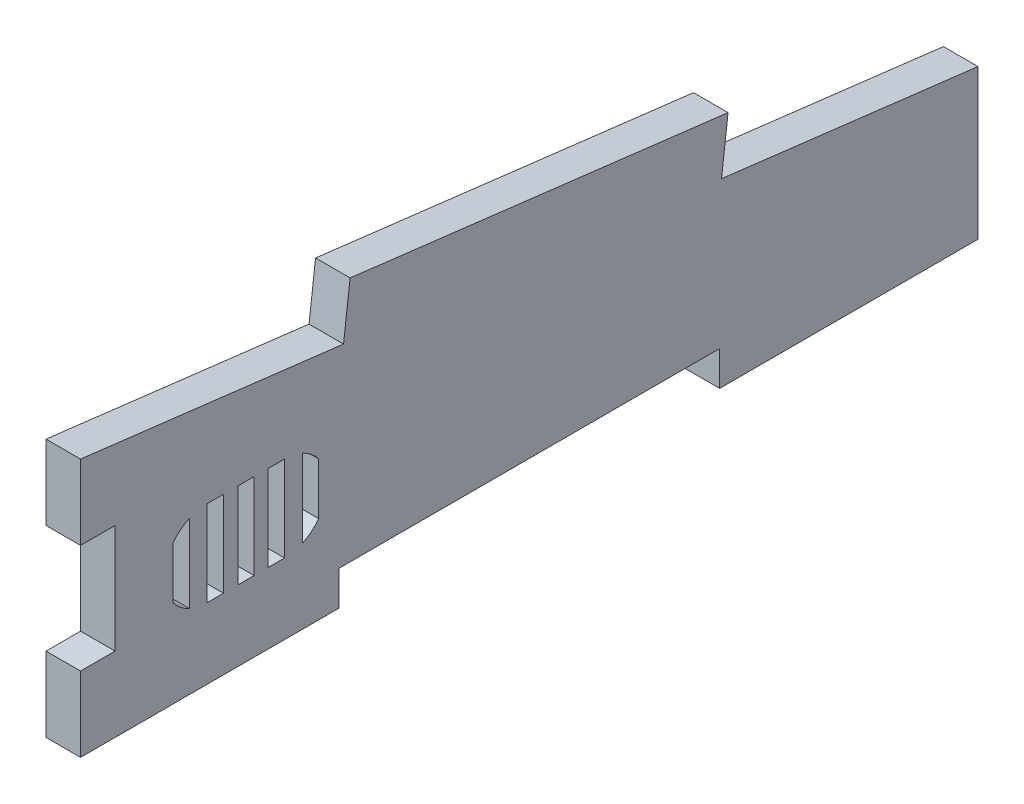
ISO-10303-21;
HEADER;
FILE_DESCRIPTION(('STEP AP214'),'2;1');
FILE_NAME('part.step','',(''),(''),'','','');
FILE_SCHEMA(('AUTOMOTIVE_DESIGN { 1 0 10303 214 1 1 1 1 }'));
ENDSEC;
DATA;
#1=APPLICATION_CONTEXT('core data for automotive mechanical design processes');
#2=APPLICATION_PROTOCOL_DEFINITION('international standard','automotive_design',2000,#1);
#3=PRODUCT_CONTEXT('',#1,'mechanical');
#4=PRODUCT('Part','Part','',(#3));
#5=PRODUCT_RELATED_PRODUCT_CATEGORY('part','',(#4));
#6=PRODUCT_DEFINITION_FORMATION('','',#4);
#7=PRODUCT_DEFINITION_CONTEXT('part definition',#1,'design');
#8=PRODUCT_DEFINITION('design','',#6,#7);
#9=PRODUCT_DEFINITION_SHAPE('','',#8);
#10=(LENGTH_UNIT() NAMED_UNIT(*) SI_UNIT(.MILLI.,.METRE.));
#11=(NAMED_UNIT(*) PLANE_ANGLE_UNIT() SI_UNIT($,.RADIAN.));
#12=(NAMED_UNIT(*) SI_UNIT($,.STERADIAN.) SOLID_ANGLE_UNIT());
#13=UNCERTAINTY_MEASURE_WITH_UNIT(LENGTH_MEASURE(1.E-05),#10,'distance_accuracy_value','');
#14=(GEOMETRIC_REPRESENTATION_CONTEXT(3) GLOBAL_UNCERTAINTY_ASSIGNED_CONTEXT((#13)) GLOBAL_UNIT_ASSIGNED_CONTEXT((#10,
#11,#12)) REPRESENTATION_CONTEXT('',''));
#15=CARTESIAN_POINT('',(0.,0.,0.));
#16=DIRECTION('',(0.,0.,1.));
#17=DIRECTION('',(1.,0.,0.));
#18=AXIS2_PLACEMENT_3D('',#15,#16,#17);
#19=CARTESIAN_POINT('',(6.35,0.,0.));
#20=DIRECTION('',(-1.,0.,0.));
#21=DIRECTION('',(0.,0.,1.));
#22=AXIS2_PLACEMENT_3D('',#19,#20,#21);
#23=PLANE('',#22);
#24=DIRECTION('',(0.,0.,1.));
#25=VECTOR('',#24,1.);
#26=CARTESIAN_POINT('',(6.35,-41.073724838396,96.0034406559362));
#27=LINE('',#26,#25);
#28=CARTESIAN_POINT('',(6.35,-41.073724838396,96.0034406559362));
#29=VERTEX_POINT('',#28);
#30=CARTESIAN_POINT('',(6.35,-41.073724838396,99.0034406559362));
#31=VERTEX_POINT('',#30);
#32=EDGE_CURVE('E306',#29,#31,#27,.T.);
#33=ORIENTED_EDGE('',*,*,#32,.F.);
#34=DIRECTION('',(0.,1.,0.));
#35=VECTOR('',#34,1.);
#36=CARTESIAN_POINT('',(6.35,-41.073724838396,96.0034406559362));
#37=LINE('',#36,#35);
#38=CARTESIAN_POINT('',(6.35,-56.8333333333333,96.0034406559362));
#39=VERTEX_POINT('',#38);
#40=EDGE_CURVE('E314',#39,#29,#37,.T.);
#41=ORIENTED_EDGE('',*,*,#40,.F.);
#42=DIRECTION('',(0.,0.,-1.));
#43=VECTOR('',#42,1.);
#44=CARTESIAN_POINT('',(6.35,-56.8333333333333,96.0034406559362));
#45=LINE('',#44,#43);
#46=CARTESIAN_POINT('',(6.35,-56.8333333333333,99.0034406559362));
#47=VERTEX_POINT('',#46);
#48=EDGE_CURVE('E311',#47,#39,#45,.T.);
#49=ORIENTED_EDGE('',*,*,#48,.F.);
#50=DIRECTION('',(0.,-1.,0.));
#51=VECTOR('',#50,1.);
#52=CARTESIAN_POINT('',(6.35,-41.073724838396,99.0034406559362));
#53=LINE('',#52,#51);
#54=EDGE_CURVE('E308',#31,#47,#53,.T.);
#55=ORIENTED_EDGE('',*,*,#54,.F.);
#56=EDGE_LOOP('',(#33,#41,#49,#55));
#57=FACE_BOUND('',#56,.T.);
#58=DIRECTION('',(0.,0.,-1.));
#59=VECTOR('',#58,1.);
#60=CARTESIAN_POINT('',(6.35,-56.8333333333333,101.635580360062));
#61=LINE('',#60,#59);
#62=CARTESIAN_POINT('',(6.35,-56.8333333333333,104.635580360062));
#63=VERTEX_POINT('',#62);
#64=CARTESIAN_POINT('',(6.35,-56.8333333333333,101.635580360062));
#65=VERTEX_POINT('',#64);
#66=EDGE_CURVE('E368',#63,#65,#61,.T.);
#67=ORIENTED_EDGE('',*,*,#66,.F.);
#68=DIRECTION('',(0.,-1.,0.));
#69=VECTOR('',#68,1.);
#70=CARTESIAN_POINT('',(6.35,-41.073724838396,104.635580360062));
#71=LINE('',#70,#69);
#72=CARTESIAN_POINT('',(6.35,-41.073724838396,104.635580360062));
#73=VERTEX_POINT('',#72);
#74=EDGE_CURVE('E376',#73,#63,#71,.T.);
#75=ORIENTED_EDGE('',*,*,#74,.F.);
#76=DIRECTION('',(0.,0.,1.));
#77=VECTOR('',#76,1.);
#78=CARTESIAN_POINT('',(6.35,-41.073724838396,101.635580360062));
#79=LINE('',#78,#77);
#80=CARTESIAN_POINT('',(6.35,-41.073724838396,101.635580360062));
#81=VERTEX_POINT('',#80);
#82=EDGE_CURVE('E373',#81,#73,#79,.T.);
#83=ORIENTED_EDGE('',*,*,#82,.F.);
#84=DIRECTION('',(0.,1.,0.));
#85=VECTOR('',#84,1.);
#86=CARTESIAN_POINT('',(6.35,-56.8333333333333,101.635580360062));
#87=LINE('',#86,#85);
#88=EDGE_CURVE('E370',#65,#81,#87,.T.);
#89=ORIENTED_EDGE('',*,*,#88,.F.);
#90=EDGE_LOOP('',(#67,#75,#83,#89));
#91=FACE_BOUND('',#90,.T.);
#92=DIRECTION('',(0.,0.120331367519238,0.992733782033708));
#93=VECTOR('',#92,1.);
#94=CARTESIAN_POINT('',(6.35,-28.194397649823,79.5600376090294));
#95=LINE('',#94,#93);
#96=CARTESIAN_POINT('',(6.35,-28.194397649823,79.5600376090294));
#97=VERTEX_POINT('',#96);
#98=CARTESIAN_POINT('',(6.35,-22.3333333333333,127.913818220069));
#99=VERTEX_POINT('',#98);
#100=EDGE_CURVE('E430',#97,#99,#95,.T.);
#101=ORIENTED_EDGE('',*,*,#100,.T.);
#102=DIRECTION('',(0.,-1.,0.));
#103=VECTOR('',#102,1.);
#104=CARTESIAN_POINT('',(6.35,-22.3333333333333,127.913818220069));
#105=LINE('',#104,#103);
#106=CARTESIAN_POINT('',(6.35,-36.0833333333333,127.913818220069));
#107=VERTEX_POINT('',#106);
#108=EDGE_CURVE('E433',#99,#107,#105,.T.);
#109=ORIENTED_EDGE('',*,*,#108,.T.);
#110=DIRECTION('',(0.,0.,-1.));
#111=VECTOR('',#110,1.);
#112=CARTESIAN_POINT('',(6.35,-36.0833333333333,127.913818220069));
#113=LINE('',#112,#111);
#114=CARTESIAN_POINT('',(6.35,-36.0833333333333,121.563818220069));
#115=VERTEX_POINT('',#114);
#116=EDGE_CURVE('E436',#107,#115,#113,.T.);
#117=ORIENTED_EDGE('',*,*,#116,.T.);
#118=DIRECTION('',(0.,-1.,0.));
#119=VECTOR('',#118,1.);
#120=CARTESIAN_POINT('',(6.35,-36.0833333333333,121.563818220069));
#121=LINE('',#120,#119);
#122=CARTESIAN_POINT('',(6.35,-56.0833333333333,121.563818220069));
#123=VERTEX_POINT('',#122);
#124=EDGE_CURVE('E438',#115,#123,#121,.T.);
#125=ORIENTED_EDGE('',*,*,#124,.T.);
#126=DIRECTION('',(0.,0.,1.));
#127=VECTOR('',#126,1.);
#128=CARTESIAN_POINT('',(6.35,-56.0833333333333,127.913818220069));
#129=LINE('',#128,#127);
#130=CARTESIAN_POINT('',(6.35,-56.0833333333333,127.913818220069));
#131=VERTEX_POINT('',#130);
#132=EDGE_CURVE('E440',#123,#131,#129,.T.);
#133=ORIENTED_EDGE('',*,*,#132,.T.);
#134=DIRECTION('',(0.,-1.,0.));
#135=VECTOR('',#134,1.);
#136=CARTESIAN_POINT('',(6.35,-56.0833333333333,127.913818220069));
#137=LINE('',#136,#135);
#138=CARTESIAN_POINT('',(6.35,-69.8333333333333,127.913818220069));
#139=VERTEX_POINT('',#138);
#140=EDGE_CURVE('E442',#131,#139,#137,.T.);
#141=ORIENTED_EDGE('',*,*,#140,.T.);
#142=DIRECTION('',(0.,0.,-1.));
#143=VECTOR('',#142,1.);
#144=CARTESIAN_POINT('',(6.35,-69.8333333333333,127.913818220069));
#145=LINE('',#144,#143);
#146=CARTESIAN_POINT('',(6.35,-69.8333333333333,80.4138182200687));
#147=VERTEX_POINT('',#146);
#148=EDGE_CURVE('E444',#139,#147,#145,.T.);
#149=ORIENTED_EDGE('',*,*,#148,.T.);
#150=DIRECTION('',(0.,1.,0.));
#151=VECTOR('',#150,1.);
#152=CARTESIAN_POINT('',(6.35,-69.8333333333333,80.4138182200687));
#153=LINE('',#152,#151);
#154=CARTESIAN_POINT('',(6.35,-63.4833333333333,80.4138182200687));
#155=VERTEX_POINT('',#154);
#156=EDGE_CURVE('E446',#147,#155,#153,.T.);
#157=ORIENTED_EDGE('',*,*,#156,.T.);
#158=DIRECTION('',(0.,0.,-1.));
#159=VECTOR('',#158,1.);
#160=CARTESIAN_POINT('',(6.35,-63.4833333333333,80.4138182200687));
#161=LINE('',#160,#159);
#162=CARTESIAN_POINT('',(6.35,-63.4833333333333,10.4138182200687));
#163=VERTEX_POINT('',#162);
#164=EDGE_CURVE('E448',#155,#163,#161,.T.);
#165=ORIENTED_EDGE('',*,*,#164,.T.);
#166=DIRECTION('',(0.,-1.,0.));
#167=VECTOR('',#166,1.);
#168=CARTESIAN_POINT('',(6.35,-69.8333333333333,10.4138182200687));
#169=LINE('',#168,#167);
#170=CARTESIAN_POINT('',(6.35,-69.8333333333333,10.4138182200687));
#171=VERTEX_POINT('',#170);
#172=EDGE_CURVE('E450',#163,#171,#169,.T.);
#173=ORIENTED_EDGE('',*,*,#172,.T.);
#174=DIRECTION('',(0.,0.,-1.));
#175=VECTOR('',#174,1.);
#176=CARTESIAN_POINT('',(6.35,-69.8333333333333,10.4138182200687));
#177=LINE('',#176,#175);
#178=CARTESIAN_POINT('',(6.35,-69.8333333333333,-37.0861817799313));
#179=VERTEX_POINT('',#178);
#180=EDGE_CURVE('E452',#171,#179,#177,.T.);
#181=ORIENTED_EDGE('',*,*,#180,.T.);
#182=DIRECTION('',(0.,1.,0.));
#183=VECTOR('',#182,1.);
#184=CARTESIAN_POINT('',(6.35,-69.8333333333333,-37.0861817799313));
#185=LINE('',#184,#183);
#186=CARTESIAN_POINT('',(6.35,-42.3333333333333,-37.0861817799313));
#187=VERTEX_POINT('',#186);
#188=EDGE_CURVE('E454',#179,#187,#185,.T.);
#189=ORIENTED_EDGE('',*,*,#188,.T.);
#190=DIRECTION('',(0.,0.120331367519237,0.992733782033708));
#191=VECTOR('',#190,1.);
#192=CARTESIAN_POINT('',(6.35,-42.3333333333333,-37.0861817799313));
#193=LINE('',#192,#191);
#194=CARTESIAN_POINT('',(6.35,-36.6175933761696,10.0686728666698));
#195=VERTEX_POINT('',#194);
#196=EDGE_CURVE('E456',#187,#195,#193,.T.);
#197=ORIENTED_EDGE('',*,*,#196,.T.);
#198=DIRECTION('',(0.,0.992733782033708,-0.120331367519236));
#199=VECTOR('',#198,1.);
#200=CARTESIAN_POINT('',(6.35,-36.6175933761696,10.0686728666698));
#201=LINE('',#200,#199);
#202=CARTESIAN_POINT('',(6.35,-26.6902555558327,8.86535919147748));
#203=VERTEX_POINT('',#202);
#204=EDGE_CURVE('E458',#195,#203,#201,.T.);
#205=ORIENTED_EDGE('',*,*,#204,.T.);
#206=DIRECTION('',(0.,0.12033136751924,0.992733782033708));
#207=VECTOR('',#206,1.);
#208=CARTESIAN_POINT('',(6.35,-18.2670598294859,78.356723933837));
#209=LINE('',#208,#207);
#210=CARTESIAN_POINT('',(6.35,-18.2670598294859,78.356723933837));
#211=VERTEX_POINT('',#210);
#212=EDGE_CURVE('E460',#203,#211,#209,.T.);
#213=ORIENTED_EDGE('',*,*,#212,.T.);
#214=DIRECTION('',(0.,-0.992733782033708,0.120331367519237));
#215=VECTOR('',#214,1.);
#216=CARTESIAN_POINT('',(6.35,-28.194397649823,79.5600376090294));
#217=LINE('',#216,#215);
#218=EDGE_CURVE('E462',#211,#97,#217,.T.);
#219=ORIENTED_EDGE('',*,*,#218,.T.);
#220=EDGE_LOOP('',(#101,#109,#117,#125,#133,#141,#149,#157,#165,#173,#181,#189,#197,#205,#213,#219));
#221=FACE_BOUND('',#220,.T.);
#222=DIRECTION('',(0.,1.,0.));
#223=VECTOR('',#222,1.);
#224=CARTESIAN_POINT('',(6.35,-41.073724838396,90.4034406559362));
#225=LINE('',#224,#223);
#226=CARTESIAN_POINT('',(6.35,-56.8333333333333,90.4034406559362));
#227=VERTEX_POINT('',#226);
#228=CARTESIAN_POINT('',(6.35,-41.073724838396,90.4034406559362));
#229=VERTEX_POINT('',#228);
#230=EDGE_CURVE('E399',#227,#229,#225,.T.);
#231=ORIENTED_EDGE('',*,*,#230,.F.);
#232=DIRECTION('',(0.,0.,-1.));
#233=VECTOR('',#232,1.);
#234=CARTESIAN_POINT('',(6.35,-56.8333333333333,90.4034406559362));
#235=LINE('',#234,#233);
#236=CARTESIAN_POINT('',(6.35,-56.8333333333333,93.4034406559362));
#237=VERTEX_POINT('',#236);
#238=EDGE_CURVE('E407',#237,#227,#235,.T.);
#239=ORIENTED_EDGE('',*,*,#238,.F.);
#240=DIRECTION('',(0.,-1.,0.));
#241=VECTOR('',#240,1.);
#242=CARTESIAN_POINT('',(6.35,-56.8333333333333,93.4034406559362));
#243=LINE('',#242,#241);
#244=CARTESIAN_POINT('',(6.35,-41.073724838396,93.4034406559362));
#245=VERTEX_POINT('',#244);
#246=EDGE_CURVE('E404',#245,#237,#243,.T.);
#247=ORIENTED_EDGE('',*,*,#246,.F.);
#248=DIRECTION('',(0.,0.,1.));
#249=VECTOR('',#248,1.);
#250=CARTESIAN_POINT('',(6.35,-41.073724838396,90.4034406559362));
#251=LINE('',#250,#249);
#252=EDGE_CURVE('E401',#229,#245,#251,.T.);
#253=ORIENTED_EDGE('',*,*,#252,.F.);
#254=EDGE_LOOP('',(#231,#239,#247,#253));
#255=FACE_BOUND('',#254,.T.);
#256=CARTESIAN_POINT('',(6.35,-48.9535290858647,104.635580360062));
#257=DIRECTION('',(1.,0.,0.));
#258=DIRECTION('',(0.,0.,-1.));
#259=AXIS2_PLACEMENT_3D('',#256,#257,#258);
#260=CIRCLE('',#259,7.87980424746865);
#261=CARTESIAN_POINT('',(6.35,-41.7880234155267,107.913818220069));
#262=VERTEX_POINT('',#261);
#263=CARTESIAN_POINT('',(6.35,-44.1916970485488,110.913818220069));
#264=VERTEX_POINT('',#263);
#265=EDGE_CURVE('E337',#262,#264,#260,.T.);
#266=ORIENTED_EDGE('',*,*,#265,.F.);
#267=DIRECTION('',(0.,1.,0.));
#268=VECTOR('',#267,1.);
#269=CARTESIAN_POINT('',(6.35,-41.7880234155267,107.913818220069));
#270=LINE('',#269,#268);
#271=CARTESIAN_POINT('',(6.35,-56.1190347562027,107.913818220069));
#272=VERTEX_POINT('',#271);
#273=EDGE_CURVE('E345',#272,#262,#270,.T.);
#274=ORIENTED_EDGE('',*,*,#273,.F.);
#275=CARTESIAN_POINT('',(6.35,-48.9535290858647,104.635580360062));
#276=DIRECTION('',(1.,0.,0.));
#277=DIRECTION('',(0.,0.,-1.));
#278=AXIS2_PLACEMENT_3D('',#275,#276,#277);
#279=CIRCLE('',#278,7.87980424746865);
#280=CARTESIAN_POINT('',(6.35,-53.7153611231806,110.913818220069));
#281=VERTEX_POINT('',#280);
#282=EDGE_CURVE('E342',#281,#272,#279,.T.);
#283=ORIENTED_EDGE('',*,*,#282,.F.);
#284=DIRECTION('',(0.,-1.,0.));
#285=VECTOR('',#284,1.);
#286=CARTESIAN_POINT('',(6.35,-44.1916970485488,110.913818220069));
#287=LINE('',#286,#285);
#288=EDGE_CURVE('E339',#264,#281,#287,.T.);
#289=ORIENTED_EDGE('',*,*,#288,.F.);
#290=EDGE_LOOP('',(#266,#274,#283,#289));
#291=FACE_BOUND('',#290,.T.);
#292=CARTESIAN_POINT('',(6.35,-48.9535290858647,90.4034406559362));
#293=DIRECTION('',(1.,0.,0.));
#294=DIRECTION('',(0.,0.,-1.));
#295=AXIS2_PLACEMENT_3D('',#292,#293,#294);
#296=CIRCLE('',#295,7.87980424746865);
#297=CARTESIAN_POINT('',(6.35,-44.1916970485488,84.1252027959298));
#298=VERTEX_POINT('',#297);
#299=CARTESIAN_POINT('',(6.35,-41.7880234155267,87.1252027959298));
#300=VERTEX_POINT('',#299);
#301=EDGE_CURVE('E270',#298,#300,#296,.T.);
#302=ORIENTED_EDGE('',*,*,#301,.F.);
#303=DIRECTION('',(0.,1.,0.));
#304=VECTOR('',#303,1.);
#305=CARTESIAN_POINT('',(6.35,-44.1916970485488,84.1252027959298));
#306=LINE('',#305,#304);
#307=CARTESIAN_POINT('',(6.35,-53.7153611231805,84.1252027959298));
#308=VERTEX_POINT('',#307);
#309=EDGE_CURVE('E292',#308,#298,#306,.T.);
#310=ORIENTED_EDGE('',*,*,#309,.F.);
#311=CARTESIAN_POINT('',(6.35,-48.9535290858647,90.4034406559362));
#312=DIRECTION('',(1.,0.,0.));
#313=DIRECTION('',(0.,0.,-1.));
#314=AXIS2_PLACEMENT_3D('',#311,#312,#313);
#315=CIRCLE('',#314,7.87980424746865);
#316=CARTESIAN_POINT('',(6.35,-56.1190347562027,87.1252027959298));
#317=VERTEX_POINT('',#316);
#318=EDGE_CURVE('E290',#317,#308,#315,.T.);
#319=ORIENTED_EDGE('',*,*,#318,.F.);
#320=DIRECTION('',(0.,-1.,0.));
#321=VECTOR('',#320,1.);
#322=CARTESIAN_POINT('',(6.35,-41.7880234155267,87.1252027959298));
#323=LINE('',#322,#321);
#324=EDGE_CURVE('E278',#300,#317,#323,.T.);
#325=ORIENTED_EDGE('',*,*,#324,.F.);
#326=EDGE_LOOP('',(#302,#310,#319,#325));
#327=FACE_BOUND('',#326,.T.);
#328=ADVANCED_FACE('F37',(#57,#91,#221,#255,#291,#327),#23,.F.);
#329=CARTESIAN_POINT('',(0.,0.,0.));
#330=DIRECTION('',(-1.,0.,0.));
#331=DIRECTION('',(0.,0.,1.));
#332=AXIS2_PLACEMENT_3D('',#329,#330,#331);
#333=PLANE('',#332);
#334=DIRECTION('',(0.,0.120331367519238,0.992733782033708));
#335=VECTOR('',#334,1.);
#336=CARTESIAN_POINT('',(0.,-28.194397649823,79.5600376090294));
#337=LINE('',#336,#335);
#338=CARTESIAN_POINT('',(0.,-28.194397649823,79.5600376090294));
#339=VERTEX_POINT('',#338);
#340=CARTESIAN_POINT('',(0.,-22.3333333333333,127.913818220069));
#341=VERTEX_POINT('',#340);
#342=EDGE_CURVE('E429',#339,#341,#337,.T.);
#343=ORIENTED_EDGE('',*,*,#342,.F.);
#344=DIRECTION('',(0.,-0.992733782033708,0.120331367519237));
#345=VECTOR('',#344,1.);
#346=CARTESIAN_POINT('',(0.,-28.194397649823,79.5600376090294));
#347=LINE('',#346,#345);
#348=CARTESIAN_POINT('',(0.,-18.2670598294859,78.356723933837));
#349=VERTEX_POINT('',#348);
#350=EDGE_CURVE('E434',#349,#339,#347,.T.);
#351=ORIENTED_EDGE('',*,*,#350,.F.);
#352=DIRECTION('',(0.,0.12033136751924,0.992733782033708));
#353=VECTOR('',#352,1.);
#354=CARTESIAN_POINT('',(0.,-18.2670598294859,78.356723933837));
#355=LINE('',#354,#353);
#356=CARTESIAN_POINT('',(0.,-26.6902555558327,8.86535919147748));
#357=VERTEX_POINT('',#356);
#358=EDGE_CURVE('E493',#357,#349,#355,.T.);
#359=ORIENTED_EDGE('',*,*,#358,.F.);
#360=DIRECTION('',(0.,0.992733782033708,-0.120331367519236));
#361=VECTOR('',#360,1.);
#362=CARTESIAN_POINT('',(0.,-36.6175933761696,10.0686728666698));
#363=LINE('',#362,#361);
#364=CARTESIAN_POINT('',(0.,-36.6175933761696,10.0686728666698));
#365=VERTEX_POINT('',#364);
#366=EDGE_CURVE('E491',#365,#357,#363,.T.);
#367=ORIENTED_EDGE('',*,*,#366,.F.);
#368=DIRECTION('',(0.,0.120331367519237,0.992733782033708));
#369=VECTOR('',#368,1.);
#370=CARTESIAN_POINT('',(0.,-42.3333333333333,-37.0861817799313));
#371=LINE('',#370,#369);
#372=CARTESIAN_POINT('',(0.,-42.3333333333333,-37.0861817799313));
#373=VERTEX_POINT('',#372);
#374=EDGE_CURVE('E489',#373,#365,#371,.T.);
#375=ORIENTED_EDGE('',*,*,#374,.F.);
#376=DIRECTION('',(0.,1.,0.));
#377=VECTOR('',#376,1.);
#378=CARTESIAN_POINT('',(0.,-69.8333333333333,-37.0861817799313));
#379=LINE('',#378,#377);
#380=CARTESIAN_POINT('',(0.,-69.8333333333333,-37.0861817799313));
#381=VERTEX_POINT('',#380);
#382=EDGE_CURVE('E487',#381,#373,#379,.T.);
#383=ORIENTED_EDGE('',*,*,#382,.F.);
#384=DIRECTION('',(0.,0.,-1.));
#385=VECTOR('',#384,1.);
#386=CARTESIAN_POINT('',(0.,-69.8333333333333,10.4138182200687));
#387=LINE('',#386,#385);
#388=CARTESIAN_POINT('',(0.,-69.8333333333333,10.4138182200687));
#389=VERTEX_POINT('',#388);
#390=EDGE_CURVE('E485',#389,#381,#387,.T.);
#391=ORIENTED_EDGE('',*,*,#390,.F.);
#392=DIRECTION('',(0.,-1.,0.));
#393=VECTOR('',#392,1.);
#394=CARTESIAN_POINT('',(0.,-69.8333333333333,10.4138182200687));
#395=LINE('',#394,#393);
#396=CARTESIAN_POINT('',(0.,-63.4833333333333,10.4138182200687));
#397=VERTEX_POINT('',#396);
#398=EDGE_CURVE('E483',#397,#389,#395,.T.);
#399=ORIENTED_EDGE('',*,*,#398,.F.);
#400=DIRECTION('',(0.,0.,-1.));
#401=VECTOR('',#400,1.);
#402=CARTESIAN_POINT('',(0.,-63.4833333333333,80.4138182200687));
#403=LINE('',#402,#401);
#404=CARTESIAN_POINT('',(0.,-63.4833333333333,80.4138182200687));
#405=VERTEX_POINT('',#404);
#406=EDGE_CURVE('E481',#405,#397,#403,.T.);
#407=ORIENTED_EDGE('',*,*,#406,.F.);
#408=DIRECTION('',(0.,1.,0.));
#409=VECTOR('',#408,1.);
#410=CARTESIAN_POINT('',(0.,-69.8333333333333,80.4138182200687));
#411=LINE('',#410,#409);
#412=CARTESIAN_POINT('',(0.,-69.8333333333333,80.4138182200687));
#413=VERTEX_POINT('',#412);
#414=EDGE_CURVE('E479',#413,#405,#411,.T.);
#415=ORIENTED_EDGE('',*,*,#414,.F.);
#416=DIRECTION('',(0.,0.,-1.));
#417=VECTOR('',#416,1.);
#418=CARTESIAN_POINT('',(0.,-69.8333333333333,127.913818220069));
#419=LINE('',#418,#417);
#420=CARTESIAN_POINT('',(0.,-69.8333333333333,127.913818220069));
#421=VERTEX_POINT('',#420);
#422=EDGE_CURVE('E477',#421,#413,#419,.T.);
#423=ORIENTED_EDGE('',*,*,#422,.F.);
#424=DIRECTION('',(0.,-1.,0.));
#425=VECTOR('',#424,1.);
#426=CARTESIAN_POINT('',(0.,-56.0833333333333,127.913818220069));
#427=LINE('',#426,#425);
#428=CARTESIAN_POINT('',(0.,-56.0833333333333,127.913818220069));
#429=VERTEX_POINT('',#428);
#430=EDGE_CURVE('E475',#429,#421,#427,.T.);
#431=ORIENTED_EDGE('',*,*,#430,.F.);
#432=DIRECTION('',(0.,0.,1.));
#433=VECTOR('',#432,1.);
#434=CARTESIAN_POINT('',(0.,-56.0833333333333,127.913818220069));
#435=LINE('',#434,#433);
#436=CARTESIAN_POINT('',(0.,-56.0833333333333,121.563818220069));
#437=VERTEX_POINT('',#436);
#438=EDGE_CURVE('E473',#437,#429,#435,.T.);
#439=ORIENTED_EDGE('',*,*,#438,.F.);
#440=DIRECTION('',(0.,-1.,0.));
#441=VECTOR('',#440,1.);
#442=CARTESIAN_POINT('',(0.,-36.0833333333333,121.563818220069));
#443=LINE('',#442,#441);
#444=CARTESIAN_POINT('',(0.,-36.0833333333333,121.563818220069));
#445=VERTEX_POINT('',#444);
#446=EDGE_CURVE('E471',#445,#437,#443,.T.);
#447=ORIENTED_EDGE('',*,*,#446,.F.);
#448=DIRECTION('',(0.,0.,-1.));
#449=VECTOR('',#448,1.);
#450=CARTESIAN_POINT('',(0.,-36.0833333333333,127.913818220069));
#451=LINE('',#450,#449);
#452=CARTESIAN_POINT('',(0.,-36.0833333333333,127.913818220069));
#453=VERTEX_POINT('',#452);
#454=EDGE_CURVE('E469',#453,#445,#451,.T.);
#455=ORIENTED_EDGE('',*,*,#454,.F.);
#456=DIRECTION('',(0.,-1.,0.));
#457=VECTOR('',#456,1.);
#458=CARTESIAN_POINT('',(0.,-22.3333333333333,127.913818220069));
#459=LINE('',#458,#457);
#460=EDGE_CURVE('E467',#341,#453,#459,.T.);
#461=ORIENTED_EDGE('',*,*,#460,.F.);
#462=EDGE_LOOP('',(#343,#351,#359,#367,#375,#383,#391,#399,#407,#415,#423,#431,#439,#447,#455,#461));
#463=FACE_BOUND('',#462,.T.);
#464=DIRECTION('',(0.,0.,-1.));
#465=VECTOR('',#464,1.);
#466=CARTESIAN_POINT('',(0.,-56.8333333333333,90.4034406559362));
#467=LINE('',#466,#465);
#468=CARTESIAN_POINT('',(0.,-56.8333333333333,93.4034406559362));
#469=VERTEX_POINT('',#468);
#470=CARTESIAN_POINT('',(0.,-56.8333333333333,90.4034406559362));
#471=VERTEX_POINT('',#470);
#472=EDGE_CURVE('E402',#469,#471,#467,.T.);
#473=ORIENTED_EDGE('',*,*,#472,.T.);
#474=DIRECTION('',(0.,1.,0.));
#475=VECTOR('',#474,1.);
#476=CARTESIAN_POINT('',(0.,-41.073724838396,90.4034406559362));
#477=LINE('',#476,#475);
#478=CARTESIAN_POINT('',(0.,-41.073724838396,90.4034406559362));
#479=VERTEX_POINT('',#478);
#480=EDGE_CURVE('E398',#471,#479,#477,.T.);
#481=ORIENTED_EDGE('',*,*,#480,.T.);
#482=DIRECTION('',(0.,0.,1.));
#483=VECTOR('',#482,1.);
#484=CARTESIAN_POINT('',(0.,-41.073724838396,90.4034406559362));
#485=LINE('',#484,#483);
#486=CARTESIAN_POINT('',(0.,-41.073724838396,93.4034406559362));
#487=VERTEX_POINT('',#486);
#488=EDGE_CURVE('E412',#479,#487,#485,.T.);
#489=ORIENTED_EDGE('',*,*,#488,.T.);
#490=DIRECTION('',(0.,-1.,0.));
#491=VECTOR('',#490,1.);
#492=CARTESIAN_POINT('',(0.,-56.8333333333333,93.4034406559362));
#493=LINE('',#492,#491);
#494=EDGE_CURVE('E415',#487,#469,#493,.T.);
#495=ORIENTED_EDGE('',*,*,#494,.T.);
#496=EDGE_LOOP('',(#473,#481,#489,#495));
#497=FACE_BOUND('',#496,.T.);
#498=DIRECTION('',(0.,-1.,0.));
#499=VECTOR('',#498,1.);
#500=CARTESIAN_POINT('',(0.,-41.073724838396,104.635580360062));
#501=LINE('',#500,#499);
#502=CARTESIAN_POINT('',(0.,-41.073724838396,104.635580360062));
#503=VERTEX_POINT('',#502);
#504=CARTESIAN_POINT('',(0.,-56.8333333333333,104.635580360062));
#505=VERTEX_POINT('',#504);
#506=EDGE_CURVE('E371',#503,#505,#501,.T.);
#507=ORIENTED_EDGE('',*,*,#506,.T.);
#508=DIRECTION('',(0.,0.,-1.));
#509=VECTOR('',#508,1.);
#510=CARTESIAN_POINT('',(0.,-56.8333333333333,101.635580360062));
#511=LINE('',#510,#509);
#512=CARTESIAN_POINT('',(0.,-56.8333333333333,101.635580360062));
#513=VERTEX_POINT('',#512);
#514=EDGE_CURVE('E367',#505,#513,#511,.T.);
#515=ORIENTED_EDGE('',*,*,#514,.T.);
#516=DIRECTION('',(0.,1.,0.));
#517=VECTOR('',#516,1.);
#518=CARTESIAN_POINT('',(0.,-56.8333333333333,101.635580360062));
#519=LINE('',#518,#517);
#520=CARTESIAN_POINT('',(0.,-41.073724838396,101.635580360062));
#521=VERTEX_POINT('',#520);
#522=EDGE_CURVE('E381',#513,#521,#519,.T.);
#523=ORIENTED_EDGE('',*,*,#522,.T.);
#524=DIRECTION('',(0.,0.,1.));
#525=VECTOR('',#524,1.);
#526=CARTESIAN_POINT('',(0.,-41.073724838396,101.635580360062));
#527=LINE('',#526,#525);
#528=EDGE_CURVE('E384',#521,#503,#527,.T.);
#529=ORIENTED_EDGE('',*,*,#528,.T.);
#530=EDGE_LOOP('',(#507,#515,#523,#529));
#531=FACE_BOUND('',#530,.T.);
#532=DIRECTION('',(0.,1.,0.));
#533=VECTOR('',#532,1.);
#534=CARTESIAN_POINT('',(0.,-41.7880234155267,107.913818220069));
#535=LINE('',#534,#533);
#536=CARTESIAN_POINT('',(0.,-56.1190347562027,107.913818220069));
#537=VERTEX_POINT('',#536);
#538=CARTESIAN_POINT('',(0.,-41.7880234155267,107.913818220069));
#539=VERTEX_POINT('',#538);
#540=EDGE_CURVE('E340',#537,#539,#535,.T.);
#541=ORIENTED_EDGE('',*,*,#540,.T.);
#542=CARTESIAN_POINT('',(0.,-48.9535290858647,104.635580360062));
#543=DIRECTION('',(1.,0.,0.));
#544=DIRECTION('',(0.,0.,-1.));
#545=AXIS2_PLACEMENT_3D('',#542,#543,#544);
#546=CIRCLE('',#545,7.87980424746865);
#547=CARTESIAN_POINT('',(0.,-44.1916970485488,110.913818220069));
#548=VERTEX_POINT('',#547);
#549=EDGE_CURVE('E336',#539,#548,#546,.T.);
#550=ORIENTED_EDGE('',*,*,#549,.T.);
#551=DIRECTION('',(0.,-1.,0.));
#552=VECTOR('',#551,1.);
#553=CARTESIAN_POINT('',(0.,-44.1916970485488,110.913818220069));
#554=LINE('',#553,#552);
#555=CARTESIAN_POINT('',(0.,-53.7153611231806,110.913818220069));
#556=VERTEX_POINT('',#555);
#557=EDGE_CURVE('E350',#548,#556,#554,.T.);
#558=ORIENTED_EDGE('',*,*,#557,.T.);
#559=CARTESIAN_POINT('',(0.,-48.9535290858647,104.635580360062));
#560=DIRECTION('',(1.,0.,0.));
#561=DIRECTION('',(0.,0.,-1.));
#562=AXIS2_PLACEMENT_3D('',#559,#560,#561);
#563=CIRCLE('',#562,7.87980424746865);
#564=EDGE_CURVE('E353',#556,#537,#563,.T.);
#565=ORIENTED_EDGE('',*,*,#564,.T.);
#566=EDGE_LOOP('',(#541,#550,#558,#565));
#567=FACE_BOUND('',#566,.T.);
#568=DIRECTION('',(0.,1.,0.));
#569=VECTOR('',#568,1.);
#570=CARTESIAN_POINT('',(0.,-41.073724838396,96.0034406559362));
#571=LINE('',#570,#569);
#572=CARTESIAN_POINT('',(0.,-56.8333333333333,96.0034406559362));
#573=VERTEX_POINT('',#572);
#574=CARTESIAN_POINT('',(0.,-41.073724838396,96.0034406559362));
#575=VERTEX_POINT('',#574);
#576=EDGE_CURVE('E309',#573,#575,#571,.T.);
#577=ORIENTED_EDGE('',*,*,#576,.T.);
#578=DIRECTION('',(0.,0.,1.));
#579=VECTOR('',#578,1.);
#580=CARTESIAN_POINT('',(0.,-41.073724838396,96.0034406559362));
#581=LINE('',#580,#579);
#582=CARTESIAN_POINT('',(0.,-41.073724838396,99.0034406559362));
#583=VERTEX_POINT('',#582);
#584=EDGE_CURVE('E286',#575,#583,#581,.T.);
#585=ORIENTED_EDGE('',*,*,#584,.T.);
#586=DIRECTION('',(0.,-1.,0.));
#587=VECTOR('',#586,1.);
#588=CARTESIAN_POINT('',(0.,-41.073724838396,99.0034406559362));
#589=LINE('',#588,#587);
#590=CARTESIAN_POINT('',(0.,-56.8333333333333,99.0034406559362));
#591=VERTEX_POINT('',#590);
#592=EDGE_CURVE('E319',#583,#591,#589,.T.);
#593=ORIENTED_EDGE('',*,*,#592,.T.);
#594=DIRECTION('',(0.,0.,-1.));
#595=VECTOR('',#594,1.);
#596=CARTESIAN_POINT('',(0.,-56.8333333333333,96.0034406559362));
#597=LINE('',#596,#595);
#598=EDGE_CURVE('E322',#591,#573,#597,.T.);
#599=ORIENTED_EDGE('',*,*,#598,.T.);
#600=EDGE_LOOP('',(#577,#585,#593,#599));
#601=FACE_BOUND('',#600,.T.);
#602=DIRECTION('',(0.,1.,0.));
#603=VECTOR('',#602,1.);
#604=CARTESIAN_POINT('',(0.,-44.1916970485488,84.1252027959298));
#605=LINE('',#604,#603);
#606=CARTESIAN_POINT('',(0.,-53.7153611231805,84.1252027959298));
#607=VERTEX_POINT('',#606);
#608=CARTESIAN_POINT('',(0.,-44.1916970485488,84.1252027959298));
#609=VERTEX_POINT('',#608);
#610=EDGE_CURVE('E279',#607,#609,#605,.T.);
#611=ORIENTED_EDGE('',*,*,#610,.T.);
#612=CARTESIAN_POINT('',(0.,-48.9535290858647,90.4034406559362));
#613=DIRECTION('',(1.,0.,0.));
#614=DIRECTION('',(0.,0.,-1.));
#615=AXIS2_PLACEMENT_3D('',#612,#613,#614);
#616=CIRCLE('',#615,7.87980424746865);
#617=CARTESIAN_POINT('',(0.,-41.7880234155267,87.1252027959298));
#618=VERTEX_POINT('',#617);
#619=EDGE_CURVE('E60',#609,#618,#616,.T.);
#620=ORIENTED_EDGE('',*,*,#619,.T.);
#621=DIRECTION('',(0.,-1.,0.));
#622=VECTOR('',#621,1.);
#623=CARTESIAN_POINT('',(0.,-41.7880234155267,87.1252027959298));
#624=LINE('',#623,#622);
#625=CARTESIAN_POINT('',(0.,-56.1190347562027,87.1252027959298));
#626=VERTEX_POINT('',#625);
#627=EDGE_CURVE('E285',#618,#626,#624,.T.);
#628=ORIENTED_EDGE('',*,*,#627,.T.);
#629=CARTESIAN_POINT('',(0.,-48.9535290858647,90.4034406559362));
#630=DIRECTION('',(1.,0.,0.));
#631=DIRECTION('',(0.,0.,-1.));
#632=AXIS2_PLACEMENT_3D('',#629,#630,#631);
#633=CIRCLE('',#632,7.87980424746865);
#634=EDGE_CURVE('E298',#626,#607,#633,.T.);
#635=ORIENTED_EDGE('',*,*,#634,.T.);
#636=EDGE_LOOP('',(#611,#620,#628,#635));
#637=FACE_BOUND('',#636,.T.);
#638=ADVANCED_FACE('F547',(#463,#497,#531,#567,#601,#637),#333,.T.);
#639=CARTESIAN_POINT('',(6.35,-28.194397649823,79.5600376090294));
#640=DIRECTION('',(0.,-0.992733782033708,0.120331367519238));
#641=DIRECTION('',(0.,-0.120331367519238,-0.992733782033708));
#642=AXIS2_PLACEMENT_3D('',#639,#640,#641);
#643=PLANE('',#642);
#644=ORIENTED_EDGE('',*,*,#342,.T.);
#645=DIRECTION('',(-1.,0.,0.));
#646=VECTOR('',#645,1.);
#647=CARTESIAN_POINT('',(6.35,-22.3333333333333,127.913818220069));
#648=LINE('',#647,#646);
#649=EDGE_CURVE('E11',#99,#341,#648,.T.);
#650=ORIENTED_EDGE('',*,*,#649,.F.);
#651=ORIENTED_EDGE('',*,*,#100,.F.);
#652=DIRECTION('',(-1.,0.,0.));
#653=VECTOR('',#652,1.);
#654=CARTESIAN_POINT('',(6.35,-28.194397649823,79.5600376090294));
#655=LINE('',#654,#653);
#656=EDGE_CURVE('E464',#97,#339,#655,.T.);
#657=ORIENTED_EDGE('',*,*,#656,.T.);
#658=EDGE_LOOP('',(#644,#650,#651,#657));
#659=FACE_BOUND('',#658,.T.);
#660=ADVANCED_FACE('F39',(#659),#643,.F.);
#661=CARTESIAN_POINT('',(6.35,-22.3333333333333,127.913818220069));
#662=DIRECTION('',(0.,0.,-1.));
#663=DIRECTION('',(0.,1.,0.));
#664=AXIS2_PLACEMENT_3D('',#661,#662,#663);
#665=PLANE('',#664);
#666=ORIENTED_EDGE('',*,*,#460,.T.);
#667=DIRECTION('',(-1.,0.,0.));
#668=VECTOR('',#667,1.);
#669=CARTESIAN_POINT('',(6.35,-36.0833333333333,127.913818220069));
#670=LINE('',#669,#668);
#671=EDGE_CURVE('E45',#107,#453,#670,.T.);
#672=ORIENTED_EDGE('',*,*,#671,.F.);
#673=ORIENTED_EDGE('',*,*,#108,.F.);
#674=ORIENTED_EDGE('',*,*,#649,.T.);
#675=EDGE_LOOP('',(#666,#672,#673,#674));
#676=FACE_BOUND('',#675,.T.);
#677=ADVANCED_FACE('F565',(#676),#665,.F.);
#678=CARTESIAN_POINT('',(6.35,-36.0833333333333,127.913818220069));
#679=DIRECTION('',(0.,1.,0.));
#680=DIRECTION('',(0.,0.,1.));
#681=AXIS2_PLACEMENT_3D('',#678,#679,#680);
#682=PLANE('',#681);
#683=ORIENTED_EDGE('',*,*,#454,.T.);
#684=DIRECTION('',(-1.,0.,0.));
#685=VECTOR('',#684,1.);
#686=CARTESIAN_POINT('',(6.35,-36.0833333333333,121.563818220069));
#687=LINE('',#686,#685);
#688=EDGE_CURVE('E534',#115,#445,#687,.T.);
#689=ORIENTED_EDGE('',*,*,#688,.F.);
#690=ORIENTED_EDGE('',*,*,#116,.F.);
#691=ORIENTED_EDGE('',*,*,#671,.T.);
#692=EDGE_LOOP('',(#683,#689,#690,#691));
#693=FACE_BOUND('',#692,.T.);
#694=ADVANCED_FACE('F541',(#693),#682,.F.);
#695=CARTESIAN_POINT('',(6.35,-36.0833333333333,121.563818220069));
#696=DIRECTION('',(0.,0.,-1.));
#697=DIRECTION('',(-1.,0.,0.));
#698=AXIS2_PLACEMENT_3D('',#695,#696,#697);
#699=PLANE('',#698);
#700=ORIENTED_EDGE('',*,*,#446,.T.);
#701=DIRECTION('',(-1.,0.,0.));
#702=VECTOR('',#701,1.);
#703=CARTESIAN_POINT('',(6.35,-56.0833333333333,121.563818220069));
#704=LINE('',#703,#702);
#705=EDGE_CURVE('E531',#123,#437,#704,.T.);
#706=ORIENTED_EDGE('',*,*,#705,.F.);
#707=ORIENTED_EDGE('',*,*,#124,.F.);
#708=ORIENTED_EDGE('',*,*,#688,.T.);
#709=EDGE_LOOP('',(#700,#706,#707,#708));
#710=FACE_BOUND('',#709,.T.);
#711=ADVANCED_FACE('F553',(#710),#699,.F.);
#712=CARTESIAN_POINT('',(6.35,-56.0833333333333,127.913818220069));
#713=DIRECTION('',(0.,-1.,0.));
#714=DIRECTION('',(0.,0.,-1.));
#715=AXIS2_PLACEMENT_3D('',#712,#713,#714);
#716=PLANE('',#715);
#717=ORIENTED_EDGE('',*,*,#438,.T.);
#718=DIRECTION('',(-1.,0.,0.));
#719=VECTOR('',#718,1.);
#720=CARTESIAN_POINT('',(6.35,-56.0833333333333,127.913818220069));
#721=LINE('',#720,#719);
#722=EDGE_CURVE('E528',#131,#429,#721,.T.);
#723=ORIENTED_EDGE('',*,*,#722,.F.);
#724=ORIENTED_EDGE('',*,*,#132,.F.);
#725=ORIENTED_EDGE('',*,*,#705,.T.);
#726=EDGE_LOOP('',(#717,#723,#724,#725));
#727=FACE_BOUND('',#726,.T.);
#728=ADVANCED_FACE('F557',(#727),#716,.F.);
#729=CARTESIAN_POINT('',(6.35,-56.0833333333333,127.913818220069));
#730=DIRECTION('',(0.,0.,-1.));
#731=DIRECTION('',(0.,1.,0.));
#732=AXIS2_PLACEMENT_3D('',#729,#730,#731);
#733=PLANE('',#732);
#734=ORIENTED_EDGE('',*,*,#430,.T.);
#735=DIRECTION('',(-1.,0.,0.));
#736=VECTOR('',#735,1.);
#737=CARTESIAN_POINT('',(6.35,-69.8333333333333,127.913818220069));
#738=LINE('',#737,#736);
#739=EDGE_CURVE('E525',#139,#421,#738,.T.);
#740=ORIENTED_EDGE('',*,*,#739,.F.);
#741=ORIENTED_EDGE('',*,*,#140,.F.);
#742=ORIENTED_EDGE('',*,*,#722,.T.);
#743=EDGE_LOOP('',(#734,#740,#741,#742));
#744=FACE_BOUND('',#743,.T.);
#745=ADVANCED_FACE('F618',(#744),#733,.F.);
#746=CARTESIAN_POINT('',(6.35,-69.8333333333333,127.913818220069));
#747=DIRECTION('',(0.,1.,0.));
#748=DIRECTION('',(0.,0.,1.));
#749=AXIS2_PLACEMENT_3D('',#746,#747,#748);
#750=PLANE('',#749);
#751=ORIENTED_EDGE('',*,*,#422,.T.);
#752=DIRECTION('',(-1.,0.,0.));
#753=VECTOR('',#752,1.);
#754=CARTESIAN_POINT('',(6.35,-69.8333333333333,80.4138182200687));
#755=LINE('',#754,#753);
#756=EDGE_CURVE('E522',#147,#413,#755,.T.);
#757=ORIENTED_EDGE('',*,*,#756,.F.);
#758=ORIENTED_EDGE('',*,*,#148,.F.);
#759=ORIENTED_EDGE('',*,*,#739,.T.);
#760=EDGE_LOOP('',(#751,#757,#758,#759));
#761=FACE_BOUND('',#760,.T.);
#762=ADVANCED_FACE('F615',(#761),#750,.F.);
#763=CARTESIAN_POINT('',(6.35,-69.8333333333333,80.4138182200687));
#764=DIRECTION('',(0.,0.,1.));
#765=DIRECTION('',(1.,0.,0.));
#766=AXIS2_PLACEMENT_3D('',#763,#764,#765);
#767=PLANE('',#766);
#768=ORIENTED_EDGE('',*,*,#414,.T.);
#769=DIRECTION('',(-1.,0.,0.));
#770=VECTOR('',#769,1.);
#771=CARTESIAN_POINT('',(6.35,-63.4833333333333,80.4138182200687));
#772=LINE('',#771,#770);
#773=EDGE_CURVE('E519',#155,#405,#772,.T.);
#774=ORIENTED_EDGE('',*,*,#773,.F.);
#775=ORIENTED_EDGE('',*,*,#156,.F.);
#776=ORIENTED_EDGE('',*,*,#756,.T.);
#777=EDGE_LOOP('',(#768,#774,#775,#776));
#778=FACE_BOUND('',#777,.T.);
#779=ADVANCED_FACE('F611',(#778),#767,.F.);
#780=CARTESIAN_POINT('',(6.35,-63.4833333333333,80.4138182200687));
#781=DIRECTION('',(0.,1.,0.));
#782=DIRECTION('',(0.,0.,1.));
#783=AXIS2_PLACEMENT_3D('',#780,#781,#782);
#784=PLANE('',#783);
#785=ORIENTED_EDGE('',*,*,#406,.T.);
#786=DIRECTION('',(-1.,0.,0.));
#787=VECTOR('',#786,1.);
#788=CARTESIAN_POINT('',(6.35,-63.4833333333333,10.4138182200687));
#789=LINE('',#788,#787);
#790=EDGE_CURVE('E516',#163,#397,#789,.T.);
#791=ORIENTED_EDGE('',*,*,#790,.F.);
#792=ORIENTED_EDGE('',*,*,#164,.F.);
#793=ORIENTED_EDGE('',*,*,#773,.T.);
#794=EDGE_LOOP('',(#785,#791,#792,#793));
#795=FACE_BOUND('',#794,.T.);
#796=ADVANCED_FACE('F607',(#795),#784,.F.);
#797=CARTESIAN_POINT('',(6.35,-69.8333333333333,10.4138182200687));
#798=DIRECTION('',(0.,0.,-1.));
#799=DIRECTION('',(-1.,0.,0.));
#800=AXIS2_PLACEMENT_3D('',#797,#798,#799);
#801=PLANE('',#800);
#802=ORIENTED_EDGE('',*,*,#398,.T.);
#803=DIRECTION('',(-1.,0.,0.));
#804=VECTOR('',#803,1.);
#805=CARTESIAN_POINT('',(6.35,-69.8333333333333,10.4138182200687));
#806=LINE('',#805,#804);
#807=EDGE_CURVE('E513',#171,#389,#806,.T.);
#808=ORIENTED_EDGE('',*,*,#807,.F.);
#809=ORIENTED_EDGE('',*,*,#172,.F.);
#810=ORIENTED_EDGE('',*,*,#790,.T.);
#811=EDGE_LOOP('',(#802,#808,#809,#810));
#812=FACE_BOUND('',#811,.T.);
#813=ADVANCED_FACE('F602',(#812),#801,.F.);
#814=CARTESIAN_POINT('',(6.35,-69.8333333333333,10.4138182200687));
#815=DIRECTION('',(0.,1.,0.));
#816=DIRECTION('',(0.,0.,1.));
#817=AXIS2_PLACEMENT_3D('',#814,#815,#816);
#818=PLANE('',#817);
#819=ORIENTED_EDGE('',*,*,#390,.T.);
#820=DIRECTION('',(-1.,0.,0.));
#821=VECTOR('',#820,1.);
#822=CARTESIAN_POINT('',(6.35,-69.8333333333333,-37.0861817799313));
#823=LINE('',#822,#821);
#824=EDGE_CURVE('E510',#179,#381,#823,.T.);
#825=ORIENTED_EDGE('',*,*,#824,.F.);
#826=ORIENTED_EDGE('',*,*,#180,.F.);
#827=ORIENTED_EDGE('',*,*,#807,.T.);
#828=EDGE_LOOP('',(#819,#825,#826,#827));
#829=FACE_BOUND('',#828,.T.);
#830=ADVANCED_FACE('F596',(#829),#818,.F.);
#831=CARTESIAN_POINT('',(6.35,-69.8333333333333,-37.0861817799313));
#832=DIRECTION('',(0.,0.,1.));
#833=DIRECTION('',(1.,0.,0.));
#834=AXIS2_PLACEMENT_3D('',#831,#832,#833);
#835=PLANE('',#834);
#836=ORIENTED_EDGE('',*,*,#382,.T.);
#837=DIRECTION('',(-1.,0.,0.));
#838=VECTOR('',#837,1.);
#839=CARTESIAN_POINT('',(6.35,-42.3333333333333,-37.0861817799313));
#840=LINE('',#839,#838);
#841=EDGE_CURVE('E507',#187,#373,#840,.T.);
#842=ORIENTED_EDGE('',*,*,#841,.F.);
#843=ORIENTED_EDGE('',*,*,#188,.F.);
#844=ORIENTED_EDGE('',*,*,#824,.T.);
#845=EDGE_LOOP('',(#836,#842,#843,#844));
#846=FACE_BOUND('',#845,.T.);
#847=ADVANCED_FACE('F592',(#846),#835,.F.);
#848=CARTESIAN_POINT('',(6.35,-42.3333333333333,-37.0861817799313));
#849=DIRECTION('',(0.,-0.992733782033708,0.120331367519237));
#850=DIRECTION('',(0.,-0.120331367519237,-0.992733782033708));
#851=AXIS2_PLACEMENT_3D('',#848,#849,#850);
#852=PLANE('',#851);
#853=ORIENTED_EDGE('',*,*,#374,.T.);
#854=DIRECTION('',(-1.,0.,0.));
#855=VECTOR('',#854,1.);
#856=CARTESIAN_POINT('',(6.35,-36.6175933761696,10.0686728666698));
#857=LINE('',#856,#855);
#858=EDGE_CURVE('E504',#195,#365,#857,.T.);
#859=ORIENTED_EDGE('',*,*,#858,.F.);
#860=ORIENTED_EDGE('',*,*,#196,.F.);
#861=ORIENTED_EDGE('',*,*,#841,.T.);
#862=EDGE_LOOP('',(#853,#859,#860,#861));
#863=FACE_BOUND('',#862,.T.);
#864=ADVANCED_FACE('F587',(#863),#852,.F.);
#865=CARTESIAN_POINT('',(6.35,-36.6175933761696,10.0686728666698));
#866=DIRECTION('',(0.,0.120331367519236,0.992733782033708));
#867=DIRECTION('',(0.,-0.992733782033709,0.120331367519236));
#868=AXIS2_PLACEMENT_3D('',#865,#866,#867);
#869=PLANE('',#868);
#870=ORIENTED_EDGE('',*,*,#366,.T.);
#871=DIRECTION('',(-1.,0.,0.));
#872=VECTOR('',#871,1.);
#873=CARTESIAN_POINT('',(6.35,-26.6902555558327,8.86535919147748));
#874=LINE('',#873,#872);
#875=EDGE_CURVE('E501',#203,#357,#874,.T.);
#876=ORIENTED_EDGE('',*,*,#875,.F.);
#877=ORIENTED_EDGE('',*,*,#204,.F.);
#878=ORIENTED_EDGE('',*,*,#858,.T.);
#879=EDGE_LOOP('',(#870,#876,#877,#878));
#880=FACE_BOUND('',#879,.T.);
#881=ADVANCED_FACE('F581',(#880),#869,.F.);
#882=CARTESIAN_POINT('',(6.35,-18.2670598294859,78.356723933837));
#883=DIRECTION('',(0.,-0.992733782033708,0.12033136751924));
#884=DIRECTION('',(0.,-0.12033136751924,-0.992733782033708));
#885=AXIS2_PLACEMENT_3D('',#882,#883,#884);
#886=PLANE('',#885);
#887=ORIENTED_EDGE('',*,*,#358,.T.);
#888=DIRECTION('',(-1.,0.,0.));
#889=VECTOR('',#888,1.);
#890=CARTESIAN_POINT('',(6.35,-18.2670598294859,78.356723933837));
#891=LINE('',#890,#889);
#892=EDGE_CURVE('E498',#211,#349,#891,.T.);
#893=ORIENTED_EDGE('',*,*,#892,.F.);
#894=ORIENTED_EDGE('',*,*,#212,.F.);
#895=ORIENTED_EDGE('',*,*,#875,.T.);
#896=EDGE_LOOP('',(#887,#893,#894,#895));
#897=FACE_BOUND('',#896,.T.);
#898=ADVANCED_FACE('F577',(#897),#886,.F.);
#899=CARTESIAN_POINT('',(6.35,-28.194397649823,79.5600376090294));
#900=DIRECTION('',(0.,-0.120331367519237,-0.992733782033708));
#901=DIRECTION('',(0.,0.992733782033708,-0.120331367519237));
#902=AXIS2_PLACEMENT_3D('',#899,#900,#901);
#903=PLANE('',#902);
#904=ORIENTED_EDGE('',*,*,#350,.T.);
#905=ORIENTED_EDGE('',*,*,#656,.F.);
#906=ORIENTED_EDGE('',*,*,#218,.F.);
#907=ORIENTED_EDGE('',*,*,#892,.T.);
#908=EDGE_LOOP('',(#904,#905,#906,#907));
#909=FACE_BOUND('',#908,.T.);
#910=ADVANCED_FACE('F572',(#909),#903,.F.);
#911=CARTESIAN_POINT('',(6.35,-41.073724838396,90.4034406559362));
#912=DIRECTION('',(0.,0.,1.));
#913=DIRECTION('',(1.,0.,0.));
#914=AXIS2_PLACEMENT_3D('',#911,#912,#913);
#915=PLANE('',#914);
#916=ORIENTED_EDGE('',*,*,#480,.F.);
#917=DIRECTION('',(-1.,0.,0.));
#918=VECTOR('',#917,1.);
#919=CARTESIAN_POINT('',(6.35,-56.8333333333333,90.4034406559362));
#920=LINE('',#919,#918);
#921=EDGE_CURVE('E409',#227,#471,#920,.T.);
#922=ORIENTED_EDGE('',*,*,#921,.F.);
#923=ORIENTED_EDGE('',*,*,#230,.T.);
#924=DIRECTION('',(-1.,0.,0.));
#925=VECTOR('',#924,1.);
#926=CARTESIAN_POINT('',(6.35,-41.073724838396,90.4034406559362));
#927=LINE('',#926,#925);
#928=EDGE_CURVE('E426',#229,#479,#927,.T.);
#929=ORIENTED_EDGE('',*,*,#928,.T.);
#930=EDGE_LOOP('',(#916,#922,#923,#929));
#931=FACE_BOUND('',#930,.T.);
#932=ADVANCED_FACE('F637',(#931),#915,.T.);
#933=CARTESIAN_POINT('',(6.35,-41.073724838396,90.4034406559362));
#934=DIRECTION('',(0.,-1.,0.));
#935=DIRECTION('',(0.,0.,-1.));
#936=AXIS2_PLACEMENT_3D('',#933,#934,#935);
#937=PLANE('',#936);
#938=ORIENTED_EDGE('',*,*,#488,.F.);
#939=ORIENTED_EDGE('',*,*,#928,.F.);
#940=ORIENTED_EDGE('',*,*,#252,.T.);
#941=DIRECTION('',(-1.,0.,0.));
#942=VECTOR('',#941,1.);
#943=CARTESIAN_POINT('',(6.35,-41.073724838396,93.4034406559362));
#944=LINE('',#943,#942);
#945=EDGE_CURVE('E424',#245,#487,#944,.T.);
#946=ORIENTED_EDGE('',*,*,#945,.T.);
#947=EDGE_LOOP('',(#938,#939,#940,#946));
#948=FACE_BOUND('',#947,.T.);
#949=ADVANCED_FACE('F699',(#948),#937,.T.);
#950=CARTESIAN_POINT('',(6.35,-56.8333333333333,93.4034406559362));
#951=DIRECTION('',(0.,0.,-1.));
#952=DIRECTION('',(-1.,0.,0.));
#953=AXIS2_PLACEMENT_3D('',#950,#951,#952);
#954=PLANE('',#953);
#955=ORIENTED_EDGE('',*,*,#494,.F.);
#956=ORIENTED_EDGE('',*,*,#945,.F.);
#957=ORIENTED_EDGE('',*,*,#246,.T.);
#958=DIRECTION('',(-1.,0.,0.));
#959=VECTOR('',#958,1.);
#960=CARTESIAN_POINT('',(6.35,-56.8333333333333,93.4034406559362));
#961=LINE('',#960,#959);
#962=EDGE_CURVE('E422',#237,#469,#961,.T.);
#963=ORIENTED_EDGE('',*,*,#962,.T.);
#964=EDGE_LOOP('',(#955,#956,#957,#963));
#965=FACE_BOUND('',#964,.T.);
#966=ADVANCED_FACE('F706',(#965),#954,.T.);
#967=CARTESIAN_POINT('',(6.35,-56.8333333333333,90.4034406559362));
#968=DIRECTION('',(0.,1.,0.));
#969=DIRECTION('',(0.,0.,1.));
#970=AXIS2_PLACEMENT_3D('',#967,#968,#969);
#971=PLANE('',#970);
#972=ORIENTED_EDGE('',*,*,#472,.F.);
#973=ORIENTED_EDGE('',*,*,#962,.F.);
#974=ORIENTED_EDGE('',*,*,#238,.T.);
#975=ORIENTED_EDGE('',*,*,#921,.T.);
#976=EDGE_LOOP('',(#972,#973,#974,#975));
#977=FACE_BOUND('',#976,.T.);
#978=ADVANCED_FACE('F713',(#977),#971,.T.);
#979=CARTESIAN_POINT('',(6.35,-56.8333333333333,101.635580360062));
#980=DIRECTION('',(0.,1.,0.));
#981=DIRECTION('',(0.,0.,1.));
#982=AXIS2_PLACEMENT_3D('',#979,#980,#981);
#983=PLANE('',#982);
#984=ORIENTED_EDGE('',*,*,#514,.F.);
#985=DIRECTION('',(-1.,0.,0.));
#986=VECTOR('',#985,1.);
#987=CARTESIAN_POINT('',(6.35,-56.8333333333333,104.635580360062));
#988=LINE('',#987,#986);
#989=EDGE_CURVE('E378',#63,#505,#988,.T.);
#990=ORIENTED_EDGE('',*,*,#989,.F.);
#991=ORIENTED_EDGE('',*,*,#66,.T.);
#992=DIRECTION('',(-1.,0.,0.));
#993=VECTOR('',#992,1.);
#994=CARTESIAN_POINT('',(6.35,-56.8333333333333,101.635580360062));
#995=LINE('',#994,#993);
#996=EDGE_CURVE('E395',#65,#513,#995,.T.);
#997=ORIENTED_EDGE('',*,*,#996,.T.);
#998=EDGE_LOOP('',(#984,#990,#991,#997));
#999=FACE_BOUND('',#998,.T.);
#1000=ADVANCED_FACE('F721',(#999),#983,.T.);
#1001=CARTESIAN_POINT('',(6.35,-56.8333333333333,101.635580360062));
#1002=DIRECTION('',(0.,0.,1.));
#1003=DIRECTION('',(1.,0.,0.));
#1004=AXIS2_PLACEMENT_3D('',#1001,#1002,#1003);
#1005=PLANE('',#1004);
#1006=ORIENTED_EDGE('',*,*,#522,.F.);
#1007=ORIENTED_EDGE('',*,*,#996,.F.);
#1008=ORIENTED_EDGE('',*,*,#88,.T.);
#1009=DIRECTION('',(-1.,0.,0.));
#1010=VECTOR('',#1009,1.);
#1011=CARTESIAN_POINT('',(6.35,-41.073724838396,101.635580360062));
#1012=LINE('',#1011,#1010);
#1013=EDGE_CURVE('E393',#81,#521,#1012,.T.);
#1014=ORIENTED_EDGE('',*,*,#1013,.T.);
#1015=EDGE_LOOP('',(#1006,#1007,#1008,#1014));
#1016=FACE_BOUND('',#1015,.T.);
#1017=ADVANCED_FACE('F729',(#1016),#1005,.T.);
#1018=CARTESIAN_POINT('',(6.35,-41.073724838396,101.635580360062));
#1019=DIRECTION('',(0.,-1.,0.));
#1020=DIRECTION('',(0.,0.,-1.));
#1021=AXIS2_PLACEMENT_3D('',#1018,#1019,#1020);
#1022=PLANE('',#1021);
#1023=ORIENTED_EDGE('',*,*,#528,.F.);
#1024=ORIENTED_EDGE('',*,*,#1013,.F.);
#1025=ORIENTED_EDGE('',*,*,#82,.T.);
#1026=DIRECTION('',(-1.,0.,0.));
#1027=VECTOR('',#1026,1.);
#1028=CARTESIAN_POINT('',(6.35,-41.073724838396,104.635580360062));
#1029=LINE('',#1028,#1027);
#1030=EDGE_CURVE('E391',#73,#503,#1029,.T.);
#1031=ORIENTED_EDGE('',*,*,#1030,.T.);
#1032=EDGE_LOOP('',(#1023,#1024,#1025,#1031));
#1033=FACE_BOUND('',#1032,.T.);
#1034=ADVANCED_FACE('F737',(#1033),#1022,.T.);
#1035=CARTESIAN_POINT('',(6.35,-41.073724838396,104.635580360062));
#1036=DIRECTION('',(0.,0.,-1.));
#1037=DIRECTION('',(0.,1.,0.));
#1038=AXIS2_PLACEMENT_3D('',#1035,#1036,#1037);
#1039=PLANE('',#1038);
#1040=ORIENTED_EDGE('',*,*,#506,.F.);
#1041=ORIENTED_EDGE('',*,*,#1030,.F.);
#1042=ORIENTED_EDGE('',*,*,#74,.T.);
#1043=ORIENTED_EDGE('',*,*,#989,.T.);
#1044=EDGE_LOOP('',(#1040,#1041,#1042,#1043));
#1045=FACE_BOUND('',#1044,.T.);
#1046=ADVANCED_FACE('F745',(#1045),#1039,.T.);
#1047=CARTESIAN_POINT('',(6.35,-48.9535290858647,104.635580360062));
#1048=DIRECTION('',(-1.,0.,0.));
#1049=DIRECTION('',(0.,0.,1.));
#1050=AXIS2_PLACEMENT_3D('',#1047,#1048,#1049);
#1051=CYLINDRICAL_SURFACE('',#1050,7.87980424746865);
#1052=ORIENTED_EDGE('',*,*,#549,.F.);
#1053=DIRECTION('',(-1.,0.,0.));
#1054=VECTOR('',#1053,1.);
#1055=CARTESIAN_POINT('',(6.35,-41.7880234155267,107.913818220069));
#1056=LINE('',#1055,#1054);
#1057=EDGE_CURVE('E347',#262,#539,#1056,.T.);
#1058=ORIENTED_EDGE('',*,*,#1057,.F.);
#1059=ORIENTED_EDGE('',*,*,#265,.T.);
#1060=DIRECTION('',(-1.,0.,0.));
#1061=VECTOR('',#1060,1.);
#1062=CARTESIAN_POINT('',(6.35,-44.1916970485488,110.913818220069));
#1063=LINE('',#1062,#1061);
#1064=EDGE_CURVE('E364',#264,#548,#1063,.T.);
#1065=ORIENTED_EDGE('',*,*,#1064,.T.);
#1066=EDGE_LOOP('',(#1052,#1058,#1059,#1065));
#1067=FACE_BOUND('',#1066,.T.);
#1068=ADVANCED_FACE('F753',(#1067),#1051,.F.);
#1069=CARTESIAN_POINT('',(6.35,-44.1916970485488,110.913818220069));
#1070=DIRECTION('',(0.,0.,-1.));
#1071=DIRECTION('',(-1.,0.,0.));
#1072=AXIS2_PLACEMENT_3D('',#1069,#1070,#1071);
#1073=PLANE('',#1072);
#1074=ORIENTED_EDGE('',*,*,#557,.F.);
#1075=ORIENTED_EDGE('',*,*,#1064,.F.);
#1076=ORIENTED_EDGE('',*,*,#288,.T.);
#1077=DIRECTION('',(-1.,0.,0.));
#1078=VECTOR('',#1077,1.);
#1079=CARTESIAN_POINT('',(6.35,-53.7153611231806,110.913818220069));
#1080=LINE('',#1079,#1078);
#1081=EDGE_CURVE('E362',#281,#556,#1080,.T.);
#1082=ORIENTED_EDGE('',*,*,#1081,.T.);
#1083=EDGE_LOOP('',(#1074,#1075,#1076,#1082));
#1084=FACE_BOUND('',#1083,.T.);
#1085=ADVANCED_FACE('F761',(#1084),#1073,.T.);
#1086=CARTESIAN_POINT('',(6.35,-48.9535290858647,104.635580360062));
#1087=DIRECTION('',(-1.,0.,0.));
#1088=DIRECTION('',(0.,0.,1.));
#1089=AXIS2_PLACEMENT_3D('',#1086,#1087,#1088);
#1090=CYLINDRICAL_SURFACE('',#1089,7.87980424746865);
#1091=ORIENTED_EDGE('',*,*,#564,.F.);
#1092=ORIENTED_EDGE('',*,*,#1081,.F.);
#1093=ORIENTED_EDGE('',*,*,#282,.T.);
#1094=DIRECTION('',(-1.,0.,0.));
#1095=VECTOR('',#1094,1.);
#1096=CARTESIAN_POINT('',(6.35,-56.1190347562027,107.913818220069));
#1097=LINE('',#1096,#1095);
#1098=EDGE_CURVE('E360',#272,#537,#1097,.T.);
#1099=ORIENTED_EDGE('',*,*,#1098,.T.);
#1100=EDGE_LOOP('',(#1091,#1092,#1093,#1099));
#1101=FACE_BOUND('',#1100,.T.);
#1102=ADVANCED_FACE('F769',(#1101),#1090,.F.);
#1103=CARTESIAN_POINT('',(6.35,-41.7880234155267,107.913818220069));
#1104=DIRECTION('',(0.,0.,1.));
#1105=DIRECTION('',(1.,0.,0.));
#1106=AXIS2_PLACEMENT_3D('',#1103,#1104,#1105);
#1107=PLANE('',#1106);
#1108=ORIENTED_EDGE('',*,*,#540,.F.);
#1109=ORIENTED_EDGE('',*,*,#1098,.F.);
#1110=ORIENTED_EDGE('',*,*,#273,.T.);
#1111=ORIENTED_EDGE('',*,*,#1057,.T.);
#1112=EDGE_LOOP('',(#1108,#1109,#1110,#1111));
#1113=FACE_BOUND('',#1112,.T.);
#1114=ADVANCED_FACE('F777',(#1113),#1107,.T.);
#1115=CARTESIAN_POINT('',(6.35,-41.073724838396,96.0034406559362));
#1116=DIRECTION('',(0.,-1.,0.));
#1117=DIRECTION('',(0.,0.,-1.));
#1118=AXIS2_PLACEMENT_3D('',#1115,#1116,#1117);
#1119=PLANE('',#1118);
#1120=ORIENTED_EDGE('',*,*,#584,.F.);
#1121=DIRECTION('',(-1.,0.,0.));
#1122=VECTOR('',#1121,1.);
#1123=CARTESIAN_POINT('',(6.35,-41.073724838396,96.0034406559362));
#1124=LINE('',#1123,#1122);
#1125=EDGE_CURVE('E316',#29,#575,#1124,.T.);
#1126=ORIENTED_EDGE('',*,*,#1125,.F.);
#1127=ORIENTED_EDGE('',*,*,#32,.T.);
#1128=DIRECTION('',(-1.,0.,0.));
#1129=VECTOR('',#1128,1.);
#1130=CARTESIAN_POINT('',(6.35,-41.073724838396,99.0034406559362));
#1131=LINE('',#1130,#1129);
#1132=EDGE_CURVE('E333',#31,#583,#1131,.T.);
#1133=ORIENTED_EDGE('',*,*,#1132,.T.);
#1134=EDGE_LOOP('',(#1120,#1126,#1127,#1133));
#1135=FACE_BOUND('',#1134,.T.);
#1136=ADVANCED_FACE('F785',(#1135),#1119,.T.);
#1137=CARTESIAN_POINT('',(6.35,-41.073724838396,99.0034406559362));
#1138=DIRECTION('',(0.,0.,-1.));
#1139=DIRECTION('',(-1.,0.,0.));
#1140=AXIS2_PLACEMENT_3D('',#1137,#1138,#1139);
#1141=PLANE('',#1140);
#1142=ORIENTED_EDGE('',*,*,#592,.F.);
#1143=ORIENTED_EDGE('',*,*,#1132,.F.);
#1144=ORIENTED_EDGE('',*,*,#54,.T.);
#1145=DIRECTION('',(-1.,0.,0.));
#1146=VECTOR('',#1145,1.);
#1147=CARTESIAN_POINT('',(6.35,-56.8333333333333,99.0034406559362));
#1148=LINE('',#1147,#1146);
#1149=EDGE_CURVE('E331',#47,#591,#1148,.T.);
#1150=ORIENTED_EDGE('',*,*,#1149,.T.);
#1151=EDGE_LOOP('',(#1142,#1143,#1144,#1150));
#1152=FACE_BOUND('',#1151,.T.);
#1153=ADVANCED_FACE('F793',(#1152),#1141,.T.);
#1154=CARTESIAN_POINT('',(6.35,-56.8333333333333,96.0034406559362));
#1155=DIRECTION('',(0.,1.,0.));
#1156=DIRECTION('',(0.,0.,1.));
#1157=AXIS2_PLACEMENT_3D('',#1154,#1155,#1156);
#1158=PLANE('',#1157);
#1159=ORIENTED_EDGE('',*,*,#598,.F.);
#1160=ORIENTED_EDGE('',*,*,#1149,.F.);
#1161=ORIENTED_EDGE('',*,*,#48,.T.);
#1162=DIRECTION('',(-1.,0.,0.));
#1163=VECTOR('',#1162,1.);
#1164=CARTESIAN_POINT('',(6.35,-56.8333333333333,96.0034406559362));
#1165=LINE('',#1164,#1163);
#1166=EDGE_CURVE('E329',#39,#573,#1165,.T.);
#1167=ORIENTED_EDGE('',*,*,#1166,.T.);
#1168=EDGE_LOOP('',(#1159,#1160,#1161,#1167));
#1169=FACE_BOUND('',#1168,.T.);
#1170=ADVANCED_FACE('F801',(#1169),#1158,.T.);
#1171=CARTESIAN_POINT('',(6.35,-41.073724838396,96.0034406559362));
#1172=DIRECTION('',(0.,0.,1.));
#1173=DIRECTION('',(1.,0.,0.));
#1174=AXIS2_PLACEMENT_3D('',#1171,#1172,#1173);
#1175=PLANE('',#1174);
#1176=ORIENTED_EDGE('',*,*,#576,.F.);
#1177=ORIENTED_EDGE('',*,*,#1166,.F.);
#1178=ORIENTED_EDGE('',*,*,#40,.T.);
#1179=ORIENTED_EDGE('',*,*,#1125,.T.);
#1180=EDGE_LOOP('',(#1176,#1177,#1178,#1179));
#1181=FACE_BOUND('',#1180,.T.);
#1182=ADVANCED_FACE('F809',(#1181),#1175,.T.);
#1183=CARTESIAN_POINT('',(6.35,-48.9535290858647,90.4034406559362));
#1184=DIRECTION('',(-1.,0.,0.));
#1185=DIRECTION('',(0.,0.,1.));
#1186=AXIS2_PLACEMENT_3D('',#1183,#1184,#1185);
#1187=CYLINDRICAL_SURFACE('',#1186,7.87980424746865);
#1188=ORIENTED_EDGE('',*,*,#619,.F.);
#1189=DIRECTION('',(-1.,0.,0.));
#1190=VECTOR('',#1189,1.);
#1191=CARTESIAN_POINT('',(6.35,-44.1916970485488,84.1252027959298));
#1192=LINE('',#1191,#1190);
#1193=EDGE_CURVE('E274',#298,#609,#1192,.T.);
#1194=ORIENTED_EDGE('',*,*,#1193,.F.);
#1195=ORIENTED_EDGE('',*,*,#301,.T.);
#1196=DIRECTION('',(-1.,0.,0.));
#1197=VECTOR('',#1196,1.);
#1198=CARTESIAN_POINT('',(6.35,-41.7880234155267,87.1252027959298));
#1199=LINE('',#1198,#1197);
#1200=EDGE_CURVE('E273',#300,#618,#1199,.T.);
#1201=ORIENTED_EDGE('',*,*,#1200,.T.);
#1202=EDGE_LOOP('',(#1188,#1194,#1195,#1201));
#1203=FACE_BOUND('',#1202,.T.);
#1204=ADVANCED_FACE('F272',(#1203),#1187,.F.);
#1205=CARTESIAN_POINT('',(6.35,-41.7880234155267,87.1252027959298));
#1206=DIRECTION('',(0.,0.,-1.));
#1207=DIRECTION('',(-1.,0.,0.));
#1208=AXIS2_PLACEMENT_3D('',#1205,#1206,#1207);
#1209=PLANE('',#1208);
#1210=ORIENTED_EDGE('',*,*,#627,.F.);
#1211=ORIENTED_EDGE('',*,*,#1200,.F.);
#1212=ORIENTED_EDGE('',*,*,#324,.T.);
#1213=DIRECTION('',(-1.,0.,0.));
#1214=VECTOR('',#1213,1.);
#1215=CARTESIAN_POINT('',(6.35,-56.1190347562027,87.1252027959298));
#1216=LINE('',#1215,#1214);
#1217=EDGE_CURVE('E287',#317,#626,#1216,.T.);
#1218=ORIENTED_EDGE('',*,*,#1217,.T.);
#1219=EDGE_LOOP('',(#1210,#1211,#1212,#1218));
#1220=FACE_BOUND('',#1219,.T.);
#1221=ADVANCED_FACE('F282',(#1220),#1209,.T.);
#1222=CARTESIAN_POINT('',(6.35,-48.9535290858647,90.4034406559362));
#1223=DIRECTION('',(-1.,0.,0.));
#1224=DIRECTION('',(0.,0.,1.));
#1225=AXIS2_PLACEMENT_3D('',#1222,#1223,#1224);
#1226=CYLINDRICAL_SURFACE('',#1225,7.87980424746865);
#1227=ORIENTED_EDGE('',*,*,#634,.F.);
#1228=ORIENTED_EDGE('',*,*,#1217,.F.);
#1229=ORIENTED_EDGE('',*,*,#318,.T.);
#1230=DIRECTION('',(-1.,0.,0.));
#1231=VECTOR('',#1230,1.);
#1232=CARTESIAN_POINT('',(6.35,-53.7153611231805,84.1252027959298));
#1233=LINE('',#1232,#1231);
#1234=EDGE_CURVE('E52',#308,#607,#1233,.T.);
#1235=ORIENTED_EDGE('',*,*,#1234,.T.);
#1236=EDGE_LOOP('',(#1227,#1228,#1229,#1235));
#1237=FACE_BOUND('',#1236,.T.);
#1238=ADVANCED_FACE('F830',(#1237),#1226,.F.);
#1239=CARTESIAN_POINT('',(6.35,-44.1916970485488,84.1252027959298));
#1240=DIRECTION('',(0.,0.,1.));
#1241=DIRECTION('',(1.,0.,0.));
#1242=AXIS2_PLACEMENT_3D('',#1239,#1240,#1241);
#1243=PLANE('',#1242);
#1244=ORIENTED_EDGE('',*,*,#610,.F.);
#1245=ORIENTED_EDGE('',*,*,#1234,.F.);
#1246=ORIENTED_EDGE('',*,*,#309,.T.);
#1247=ORIENTED_EDGE('',*,*,#1193,.T.);
#1248=EDGE_LOOP('',(#1244,#1245,#1246,#1247));
#1249=FACE_BOUND('',#1248,.T.);
#1250=ADVANCED_FACE('F837',(#1249),#1243,.T.);
#1251=CLOSED_SHELL('',(#328,#638,#660,#677,#694,#711,#728,#745,#762,#779,#796,#813,#830,#847,
#864,#881,#898,#910,#932,#949,#966,#978,#1000,#1017,#1034,#1046,#1068,#1085,#1102,#1114,#1136,
#1153,#1170,#1182,#1204,#1221,#1238,#1250));
#1252=MANIFOLD_SOLID_BREP('B2',#1251);
#1253=ADVANCED_BREP_SHAPE_REPRESENTATION('',(#18,#1252),#14);
#1254=SHAPE_DEFINITION_REPRESENTATION(#9,#1253);
ENDSEC;
END-ISO-10303-21;
